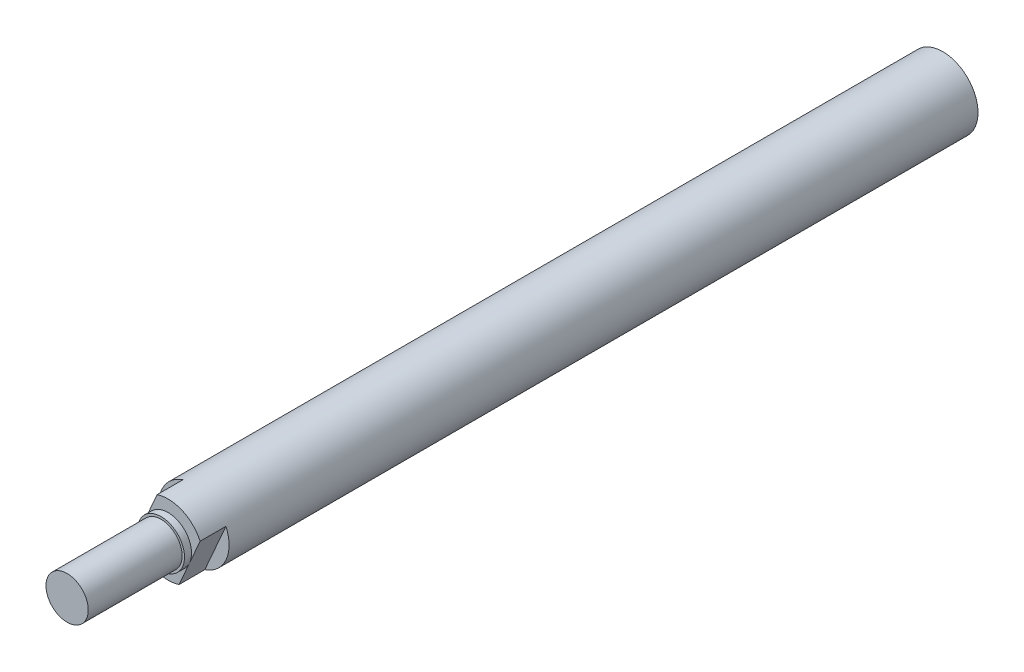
ISO-10303-21;
HEADER;
FILE_DESCRIPTION(('STEP AP214'),'2;1');
FILE_NAME('part.step','',(''),(''),'','','');
FILE_SCHEMA(('AUTOMOTIVE_DESIGN { 1 0 10303 214 1 1 1 1 }'));
ENDSEC;
DATA;
#1=APPLICATION_CONTEXT('core data for automotive mechanical design processes');
#2=APPLICATION_PROTOCOL_DEFINITION('international standard','automotive_design',2000,#1);
#3=PRODUCT_CONTEXT('',#1,'mechanical');
#4=PRODUCT('Part','Part','',(#3));
#5=PRODUCT_RELATED_PRODUCT_CATEGORY('part','',(#4));
#6=PRODUCT_DEFINITION_FORMATION('','',#4);
#7=PRODUCT_DEFINITION_CONTEXT('part definition',#1,'design');
#8=PRODUCT_DEFINITION('design','',#6,#7);
#9=PRODUCT_DEFINITION_SHAPE('','',#8);
#10=(LENGTH_UNIT() NAMED_UNIT(*) SI_UNIT(.MILLI.,.METRE.));
#11=(NAMED_UNIT(*) PLANE_ANGLE_UNIT() SI_UNIT($,.RADIAN.));
#12=(NAMED_UNIT(*) SI_UNIT($,.STERADIAN.) SOLID_ANGLE_UNIT());
#13=UNCERTAINTY_MEASURE_WITH_UNIT(LENGTH_MEASURE(1.E-05),#10,'distance_accuracy_value','');
#14=(GEOMETRIC_REPRESENTATION_CONTEXT(3) GLOBAL_UNCERTAINTY_ASSIGNED_CONTEXT((#13)) GLOBAL_UNIT_ASSIGNED_CONTEXT((#10,
#11,#12)) REPRESENTATION_CONTEXT('',''));
#15=CARTESIAN_POINT('',(0.,0.,0.));
#16=DIRECTION('',(0.,0.,1.));
#17=DIRECTION('',(1.,0.,0.));
#18=AXIS2_PLACEMENT_3D('',#15,#16,#17);
#19=CARTESIAN_POINT('',(0.,0.,238.5));
#20=DIRECTION('',(0.,0.,1.));
#21=DIRECTION('',(1.,0.,0.));
#22=AXIS2_PLACEMENT_3D('',#19,#20,#21);
#23=PLANE('',#22);
#24=CARTESIAN_POINT('',(0.,0.,238.5));
#25=DIRECTION('',(0.,0.,1.));
#26=DIRECTION('',(0.,-1.,0.));
#27=AXIS2_PLACEMENT_3D('',#24,#25,#26);
#28=CIRCLE('',#27,4.5);
#29=CARTESIAN_POINT('',(0.,-4.5,238.5));
#30=VERTEX_POINT('',#29);
#31=EDGE_CURVE('E141',#30,#30,#28,.F.);
#32=ORIENTED_EDGE('',*,*,#31,.F.);
#33=EDGE_LOOP('',(#32));
#34=FACE_BOUND('',#33,.T.);
#35=ADVANCED_FACE('F37',(#34),#23,.T.);
#36=CARTESIAN_POINT('',(0.,0.,218.5));
#37=DIRECTION('',(0.,0.,1.));
#38=DIRECTION('',(0.,-1.,0.));
#39=AXIS2_PLACEMENT_3D('',#36,#37,#38);
#40=CYLINDRICAL_SURFACE('',#39,4.5);
#41=CARTESIAN_POINT('',(0.,0.,218.5));
#42=DIRECTION('',(0.,0.,1.));
#43=DIRECTION('',(0.,-1.,0.));
#44=AXIS2_PLACEMENT_3D('',#41,#42,#43);
#45=CIRCLE('',#44,4.5);
#46=CARTESIAN_POINT('',(0.,-4.5,218.5));
#47=VERTEX_POINT('',#46);
#48=EDGE_CURVE('E137',#47,#47,#45,.F.);
#49=ORIENTED_EDGE('',*,*,#48,.F.);
#50=EDGE_LOOP('',(#49));
#51=FACE_BOUND('',#50,.T.);
#52=ORIENTED_EDGE('',*,*,#31,.T.);
#53=EDGE_LOOP('',(#52));
#54=FACE_BOUND('',#53,.T.);
#55=ADVANCED_FACE('F178',(#51,#54),#40,.T.);
#56=CARTESIAN_POINT('',(0.,0.,218.5));
#57=DIRECTION('',(0.,0.,1.));
#58=DIRECTION('',(1.,0.,0.));
#59=AXIS2_PLACEMENT_3D('',#56,#57,#58);
#60=PLANE('',#59);
#61=CARTESIAN_POINT('',(0.,0.,218.5));
#62=DIRECTION('',(0.,0.,1.));
#63=DIRECTION('',(0.,-1.,0.));
#64=AXIS2_PLACEMENT_3D('',#61,#62,#63);
#65=CIRCLE('',#64,5.);
#66=CARTESIAN_POINT('',(0.,-5.,218.5));
#67=VERTEX_POINT('',#66);
#68=EDGE_CURVE('E135',#67,#67,#65,.F.);
#69=ORIENTED_EDGE('',*,*,#68,.F.);
#70=EDGE_LOOP('',(#69));
#71=FACE_BOUND('',#70,.T.);
#72=ORIENTED_EDGE('',*,*,#48,.T.);
#73=EDGE_LOOP('',(#72));
#74=FACE_BOUND('',#73,.T.);
#75=ADVANCED_FACE('F175',(#71,#74),#60,.T.);
#76=CARTESIAN_POINT('',(0.,0.,217.));
#77=DIRECTION('',(0.,0.,1.));
#78=DIRECTION('',(0.,-1.,0.));
#79=AXIS2_PLACEMENT_3D('',#76,#77,#78);
#80=CYLINDRICAL_SURFACE('',#79,5.);
#81=CARTESIAN_POINT('',(0.,0.,217.));
#82=DIRECTION('',(0.,0.,1.));
#83=DIRECTION('',(0.,-1.,0.));
#84=AXIS2_PLACEMENT_3D('',#81,#82,#83);
#85=CIRCLE('',#84,5.);
#86=CARTESIAN_POINT('',(-4.57912825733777,2.00788057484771,217.));
#87=VERTEX_POINT('',#86);
#88=CARTESIAN_POINT('',(4.57912825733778,-2.0078805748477,217.));
#89=VERTEX_POINT('',#88);
#90=EDGE_CURVE('E81',#87,#89,#85,.F.);
#91=ORIENTED_EDGE('',*,*,#90,.F.);
#92=CARTESIAN_POINT('',(0.,0.,217.));
#93=DIRECTION('',(0.,0.,1.));
#94=DIRECTION('',(0.,-1.,0.));
#95=AXIS2_PLACEMENT_3D('',#92,#93,#94);
#96=CIRCLE('',#95,5.);
#97=EDGE_CURVE('E92',#89,#87,#96,.F.);
#98=ORIENTED_EDGE('',*,*,#97,.F.);
#99=EDGE_LOOP('',(#91,#98));
#100=FACE_BOUND('',#99,.T.);
#101=ORIENTED_EDGE('',*,*,#68,.T.);
#102=EDGE_LOOP('',(#101));
#103=FACE_BOUND('',#102,.T.);
#104=ADVANCED_FACE('F93',(#100,#103),#80,.T.);
#105=CARTESIAN_POINT('',(0.,0.,217.));
#106=DIRECTION('',(0.,0.,1.));
#107=DIRECTION('',(1.,0.,0.));
#108=AXIS2_PLACEMENT_3D('',#105,#106,#107);
#109=PLANE('',#108);
#110=CARTESIAN_POINT('',(0.,0.,217.));
#111=DIRECTION('',(0.,0.,1.));
#112=DIRECTION('',(0.,-1.,0.));
#113=AXIS2_PLACEMENT_3D('',#110,#111,#112);
#114=CIRCLE('',#113,7.5);
#115=CARTESIAN_POINT('',(-2.33424952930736,7.12750160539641,217.));
#116=VERTEX_POINT('',#115);
#117=CARTESIAN_POINT('',(6.82400698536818,3.111740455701,217.));
#118=VERTEX_POINT('',#117);
#119=EDGE_CURVE('E117',#116,#118,#114,.F.);
#120=ORIENTED_EDGE('',*,*,#119,.F.);
#121=DIRECTION('',(0.401576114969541,0.915825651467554,0.));
#122=VECTOR('',#121,1.);
#123=CARTESIAN_POINT('',(-7.4321931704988,-4.49875648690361,217.));
#124=LINE('',#123,#122);
#125=EDGE_CURVE('E88',#116,#87,#124,.F.);
#126=ORIENTED_EDGE('',*,*,#125,.T.);
#127=ORIENTED_EDGE('',*,*,#90,.T.);
#128=DIRECTION('',(-0.401576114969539,-0.915825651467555,0.));
#129=VECTOR('',#128,1.);
#130=CARTESIAN_POINT('',(7.4321931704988,4.49875648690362,217.));
#131=LINE('',#130,#129);
#132=EDGE_CURVE('E86',#89,#118,#131,.F.);
#133=ORIENTED_EDGE('',*,*,#132,.T.);
#134=EDGE_LOOP('',(#120,#126,#127,#133));
#135=FACE_BOUND('',#134,.T.);
#136=ADVANCED_FACE('F84',(#135),#109,.T.);
#137=CARTESIAN_POINT('',(5.65549274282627,-2.47985061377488,211.5));
#138=DIRECTION('',(0.,0.,1.));
#139=DIRECTION('',(1.,0.,0.));
#140=AXIS2_PLACEMENT_3D('',#137,#138,#139);
#141=PLANE('',#140);
#142=CARTESIAN_POINT('',(0.,0.,211.5));
#143=DIRECTION('',(0.,0.,1.));
#144=DIRECTION('',(0.,-1.,0.));
#145=AXIS2_PLACEMENT_3D('',#142,#143,#144);
#146=CIRCLE('',#145,7.5);
#147=CARTESIAN_POINT('',(6.82400698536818,3.111740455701,211.5));
#148=VERTEX_POINT('',#147);
#149=CARTESIAN_POINT('',(2.33424952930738,-7.1275016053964,211.5));
#150=VERTEX_POINT('',#149);
#151=EDGE_CURVE('E131',#148,#150,#146,.F.);
#152=ORIENTED_EDGE('',*,*,#151,.F.);
#153=DIRECTION('',(-0.401576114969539,-0.915825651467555,0.));
#154=VECTOR('',#153,1.);
#155=CARTESIAN_POINT('',(7.4321931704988,4.49875648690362,211.5));
#156=LINE('',#155,#154);
#157=EDGE_CURVE('E108',#148,#150,#156,.T.);
#158=ORIENTED_EDGE('',*,*,#157,.T.);
#159=EDGE_LOOP('',(#152,#158));
#160=FACE_BOUND('',#159,.T.);
#161=ADVANCED_FACE('F167',(#160),#141,.T.);
#162=CARTESIAN_POINT('',(7.4321931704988,4.49875648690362,217.));
#163=DIRECTION('',(-0.915825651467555,0.401576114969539,0.));
#164=DIRECTION('',(-0.401576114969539,-0.915825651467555,0.));
#165=AXIS2_PLACEMENT_3D('',#162,#163,#164);
#166=PLANE('',#165);
#167=ORIENTED_EDGE('',*,*,#132,.F.);
#168=DIRECTION('',(0.401576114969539,0.915825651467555,0.));
#169=VECTOR('',#168,1.);
#170=CARTESIAN_POINT('',(2.33424952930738,-7.1275016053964,217.));
#171=LINE('',#170,#169);
#172=CARTESIAN_POINT('',(2.33424952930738,-7.1275016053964,217.));
#173=VERTEX_POINT('',#172);
#174=EDGE_CURVE('E99',#173,#89,#171,.T.);
#175=ORIENTED_EDGE('',*,*,#174,.F.);
#176=DIRECTION('',(0.,0.,1.));
#177=VECTOR('',#176,1.);
#178=CARTESIAN_POINT('',(2.33424952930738,-7.1275016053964,202.));
#179=LINE('',#178,#177);
#180=EDGE_CURVE('E47',#150,#173,#179,.T.);
#181=ORIENTED_EDGE('',*,*,#180,.F.);
#182=ORIENTED_EDGE('',*,*,#157,.F.);
#183=DIRECTION('',(0.,0.,1.));
#184=VECTOR('',#183,1.);
#185=CARTESIAN_POINT('',(6.82400698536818,3.111740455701,202.));
#186=LINE('',#185,#184);
#187=EDGE_CURVE('E106',#118,#148,#186,.F.);
#188=ORIENTED_EDGE('',*,*,#187,.F.);
#189=EDGE_LOOP('',(#167,#175,#181,#182,#188));
#190=FACE_BOUND('',#189,.T.);
#191=ADVANCED_FACE('F102',(#190),#166,.F.);
#192=CARTESIAN_POINT('',(0.,0.,217.));
#193=DIRECTION('',(0.,0.,1.));
#194=DIRECTION('',(1.,0.,0.));
#195=AXIS2_PLACEMENT_3D('',#192,#193,#194);
#196=PLANE('',#195);
#197=CARTESIAN_POINT('',(0.,0.,217.));
#198=DIRECTION('',(0.,0.,1.));
#199=DIRECTION('',(0.,-1.,0.));
#200=AXIS2_PLACEMENT_3D('',#197,#198,#199);
#201=CIRCLE('',#200,7.5);
#202=CARTESIAN_POINT('',(-6.82400698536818,-3.111740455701,217.));
#203=VERTEX_POINT('',#202);
#204=EDGE_CURVE('E11',#173,#203,#201,.F.);
#205=ORIENTED_EDGE('',*,*,#204,.F.);
#206=ORIENTED_EDGE('',*,*,#174,.T.);
#207=ORIENTED_EDGE('',*,*,#97,.T.);
#208=DIRECTION('',(0.401576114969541,0.915825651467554,0.));
#209=VECTOR('',#208,1.);
#210=CARTESIAN_POINT('',(-7.4321931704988,-4.49875648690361,217.));
#211=LINE('',#210,#209);
#212=EDGE_CURVE('E98',#87,#203,#211,.F.);
#213=ORIENTED_EDGE('',*,*,#212,.T.);
#214=EDGE_LOOP('',(#205,#206,#207,#213));
#215=FACE_BOUND('',#214,.T.);
#216=ADVANCED_FACE('F110',(#215),#196,.T.);
#217=CARTESIAN_POINT('',(-7.4321931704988,-4.49875648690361,217.));
#218=DIRECTION('',(0.915825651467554,-0.401576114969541,0.));
#219=DIRECTION('',(0.401576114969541,0.915825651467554,0.));
#220=AXIS2_PLACEMENT_3D('',#217,#218,#219);
#221=PLANE('',#220);
#222=DIRECTION('',(0.401576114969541,0.915825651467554,0.));
#223=VECTOR('',#222,1.);
#224=CARTESIAN_POINT('',(-6.82400698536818,-3.111740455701,211.5));
#225=LINE('',#224,#223);
#226=CARTESIAN_POINT('',(-6.82400698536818,-3.111740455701,211.5));
#227=VERTEX_POINT('',#226);
#228=CARTESIAN_POINT('',(-2.33424952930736,7.12750160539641,211.5));
#229=VERTEX_POINT('',#228);
#230=EDGE_CURVE('E41',#227,#229,#225,.T.);
#231=ORIENTED_EDGE('',*,*,#230,.F.);
#232=DIRECTION('',(0.,0.,1.));
#233=VECTOR('',#232,1.);
#234=CARTESIAN_POINT('',(-6.82400698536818,-3.111740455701,202.));
#235=LINE('',#234,#233);
#236=EDGE_CURVE('E119',#203,#227,#235,.F.);
#237=ORIENTED_EDGE('',*,*,#236,.F.);
#238=ORIENTED_EDGE('',*,*,#212,.F.);
#239=ORIENTED_EDGE('',*,*,#125,.F.);
#240=DIRECTION('',(0.,0.,1.));
#241=VECTOR('',#240,1.);
#242=CARTESIAN_POINT('',(-2.33424952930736,7.12750160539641,202.));
#243=LINE('',#242,#241);
#244=EDGE_CURVE('E55',#229,#116,#243,.T.);
#245=ORIENTED_EDGE('',*,*,#244,.F.);
#246=EDGE_LOOP('',(#231,#237,#238,#239,#245));
#247=FACE_BOUND('',#246,.T.);
#248=ADVANCED_FACE('F157',(#247),#221,.F.);
#249=CARTESIAN_POINT('',(-5.65549274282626,2.47985061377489,211.5));
#250=DIRECTION('',(0.,0.,1.));
#251=DIRECTION('',(1.,0.,0.));
#252=AXIS2_PLACEMENT_3D('',#249,#250,#251);
#253=PLANE('',#252);
#254=CARTESIAN_POINT('',(0.,0.,211.5));
#255=DIRECTION('',(0.,0.,1.));
#256=DIRECTION('',(0.,-1.,0.));
#257=AXIS2_PLACEMENT_3D('',#254,#255,#256);
#258=CIRCLE('',#257,7.5);
#259=EDGE_CURVE('E118',#227,#229,#258,.F.);
#260=ORIENTED_EDGE('',*,*,#259,.F.);
#261=ORIENTED_EDGE('',*,*,#230,.T.);
#262=EDGE_LOOP('',(#260,#261));
#263=FACE_BOUND('',#262,.T.);
#264=ADVANCED_FACE('F127',(#263),#253,.T.);
#265=CARTESIAN_POINT('',(0.,0.,202.));
#266=DIRECTION('',(0.,0.,1.));
#267=DIRECTION('',(0.,-1.,0.));
#268=AXIS2_PLACEMENT_3D('',#265,#266,#267);
#269=CYLINDRICAL_SURFACE('',#268,7.5);
#270=ORIENTED_EDGE('',*,*,#236,.T.);
#271=ORIENTED_EDGE('',*,*,#259,.T.);
#272=ORIENTED_EDGE('',*,*,#244,.T.);
#273=ORIENTED_EDGE('',*,*,#119,.T.);
#274=ORIENTED_EDGE('',*,*,#187,.T.);
#275=ORIENTED_EDGE('',*,*,#151,.T.);
#276=ORIENTED_EDGE('',*,*,#180,.T.);
#277=ORIENTED_EDGE('',*,*,#204,.T.);
#278=EDGE_LOOP('',(#270,#271,#272,#273,#274,#275,#276,#277));
#279=FACE_BOUND('',#278,.T.);
#280=CARTESIAN_POINT('',(0.,0.,52.));
#281=DIRECTION('',(0.,0.,-1.));
#282=DIRECTION('',(-1.,0.,0.));
#283=AXIS2_PLACEMENT_3D('',#280,#281,#282);
#284=CIRCLE('',#283,7.5);
#285=CARTESIAN_POINT('',(-7.5,0.,52.));
#286=VERTEX_POINT('',#285);
#287=EDGE_CURVE('E146',#286,#286,#284,.T.);
#288=ORIENTED_EDGE('',*,*,#287,.F.);
#289=EDGE_LOOP('',(#288));
#290=FACE_BOUND('',#289,.T.);
#291=ADVANCED_FACE('F39',(#279,#290),#269,.T.);
#292=CARTESIAN_POINT('',(0.,0.,52.));
#293=DIRECTION('',(0.,0.,-1.));
#294=DIRECTION('',(-1.,0.,0.));
#295=AXIS2_PLACEMENT_3D('',#292,#293,#294);
#296=PLANE('',#295);
#297=ORIENTED_EDGE('',*,*,#287,.T.);
#298=EDGE_LOOP('',(#297));
#299=FACE_BOUND('',#298,.T.);
#300=ADVANCED_FACE('F150',(#299),#296,.T.);
#301=CLOSED_SHELL('',(#35,#55,#75,#104,#136,#161,#191,#216,#248,#264,#291,#300));
#302=MANIFOLD_SOLID_BREP('B2',#301);
#303=ADVANCED_BREP_SHAPE_REPRESENTATION('',(#18,#302),#14);
#304=SHAPE_DEFINITION_REPRESENTATION(#9,#303);
ENDSEC;
END-ISO-10303-21;
